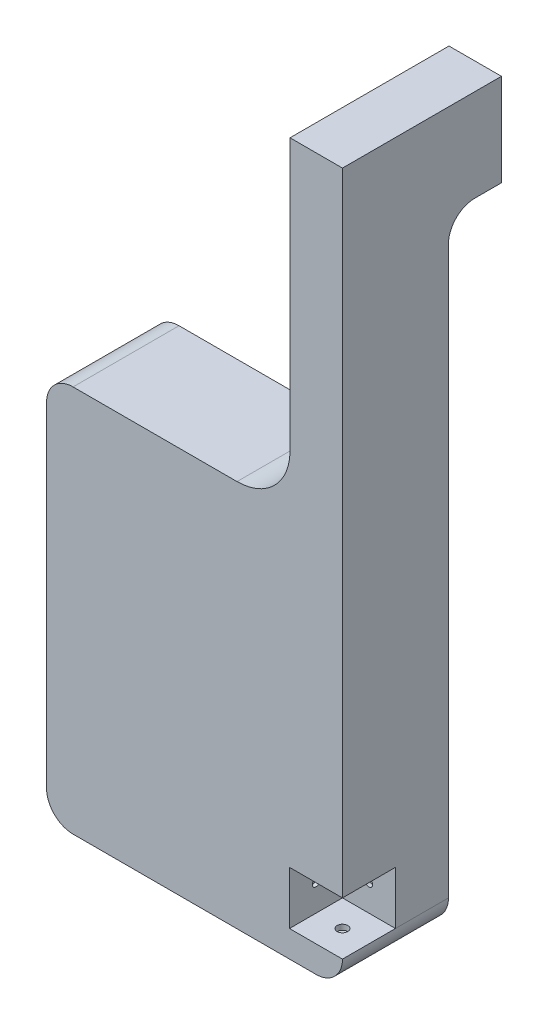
ISO-10303-21;
HEADER;
FILE_DESCRIPTION(('STEP AP214'),'2;1');
FILE_NAME('part.step','',(''),(''),'','','');
FILE_SCHEMA(('AUTOMOTIVE_DESIGN { 1 0 10303 214 1 1 1 1 }'));
ENDSEC;
DATA;
#1=APPLICATION_CONTEXT('core data for automotive mechanical design processes');
#2=APPLICATION_PROTOCOL_DEFINITION('international standard','automotive_design',2000,#1);
#3=PRODUCT_CONTEXT('',#1,'mechanical');
#4=PRODUCT('Part','Part','',(#3));
#5=PRODUCT_RELATED_PRODUCT_CATEGORY('part','',(#4));
#6=PRODUCT_DEFINITION_FORMATION('','',#4);
#7=PRODUCT_DEFINITION_CONTEXT('part definition',#1,'design');
#8=PRODUCT_DEFINITION('design','',#6,#7);
#9=PRODUCT_DEFINITION_SHAPE('','',#8);
#10=(LENGTH_UNIT() NAMED_UNIT(*) SI_UNIT(.MILLI.,.METRE.));
#11=(NAMED_UNIT(*) PLANE_ANGLE_UNIT() SI_UNIT($,.RADIAN.));
#12=(NAMED_UNIT(*) SI_UNIT($,.STERADIAN.) SOLID_ANGLE_UNIT());
#13=UNCERTAINTY_MEASURE_WITH_UNIT(LENGTH_MEASURE(1.E-05),#10,'distance_accuracy_value','');
#14=(GEOMETRIC_REPRESENTATION_CONTEXT(3) GLOBAL_UNCERTAINTY_ASSIGNED_CONTEXT((#13)) GLOBAL_UNIT_ASSIGNED_CONTEXT((#10,
#11,#12)) REPRESENTATION_CONTEXT('',''));
#15=CARTESIAN_POINT('',(0.,0.,0.));
#16=DIRECTION('',(0.,0.,1.));
#17=DIRECTION('',(1.,0.,0.));
#18=AXIS2_PLACEMENT_3D('',#15,#16,#17);
#19=CARTESIAN_POINT('',(5.44816399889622,-9.36239713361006,0.));
#20=DIRECTION('',(0.,0.,1.));
#21=DIRECTION('',(1.,0.,0.));
#22=AXIS2_PLACEMENT_3D('',#19,#20,#21);
#23=PLANE('',#22);
#24=DIRECTION('',(0.,-1.,0.));
#25=VECTOR('',#24,1.);
#26=CARTESIAN_POINT('',(4.20382112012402,10.4736127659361,0.));
#27=LINE('',#26,#25);
#28=CARTESIAN_POINT('',(4.20382112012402,17.782031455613,0.));
#29=VERTEX_POINT('',#28);
#30=CARTESIAN_POINT('',(4.20382112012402,10.4736127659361,0.));
#31=VERTEX_POINT('',#30);
#32=EDGE_CURVE('E217',#29,#31,#27,.T.);
#33=ORIENTED_EDGE('',*,*,#32,.F.);
#34=DIRECTION('',(-1.,0.,0.));
#35=VECTOR('',#34,1.);
#36=CARTESIAN_POINT('',(6.71816399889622,17.782031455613,0.));
#37=LINE('',#36,#35);
#38=CARTESIAN_POINT('',(6.71816399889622,17.782031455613,0.));
#39=VERTEX_POINT('',#38);
#40=EDGE_CURVE('E231',#29,#39,#37,.F.);
#41=ORIENTED_EDGE('',*,*,#40,.T.);
#42=DIRECTION('',(0.,1.,0.));
#43=VECTOR('',#42,1.);
#44=CARTESIAN_POINT('',(6.71816399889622,23.4754600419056,0.));
#45=LINE('',#44,#43);
#46=CARTESIAN_POINT('',(6.71816399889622,-9.36239713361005,0.));
#47=VERTEX_POINT('',#46);
#48=EDGE_CURVE('E213',#47,#39,#45,.T.);
#49=ORIENTED_EDGE('',*,*,#48,.F.);
#50=CARTESIAN_POINT('',(5.44816399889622,-9.36239713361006,0.));
#51=DIRECTION('',(0.,0.,1.));
#52=DIRECTION('',(1.,0.,0.));
#53=AXIS2_PLACEMENT_3D('',#50,#51,#52);
#54=CIRCLE('',#53,1.27);
#55=CARTESIAN_POINT('',(5.44816399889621,-10.6323971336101,0.));
#56=VERTEX_POINT('',#55);
#57=EDGE_CURVE('E188',#56,#47,#54,.T.);
#58=ORIENTED_EDGE('',*,*,#57,.F.);
#59=DIRECTION('',(1.,0.,0.));
#60=VECTOR('',#59,1.);
#61=CARTESIAN_POINT('',(-6.19574889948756,-10.6323971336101,0.));
#62=LINE('',#61,#60);
#63=CARTESIAN_POINT('',(-6.19574889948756,-10.6323971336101,0.));
#64=VERTEX_POINT('',#63);
#65=EDGE_CURVE('E284',#64,#56,#62,.T.);
#66=ORIENTED_EDGE('',*,*,#65,.F.);
#67=CARTESIAN_POINT('',(-6.19574889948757,-9.36239713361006,0.));
#68=DIRECTION('',(0.,0.,1.));
#69=DIRECTION('',(-1.,0.,0.));
#70=AXIS2_PLACEMENT_3D('',#67,#68,#69);
#71=CIRCLE('',#70,1.27);
#72=CARTESIAN_POINT('',(-7.46574889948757,-9.36239713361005,0.));
#73=VERTEX_POINT('',#72);
#74=EDGE_CURVE('E286',#73,#64,#71,.T.);
#75=ORIENTED_EDGE('',*,*,#74,.F.);
#76=DIRECTION('',(0.,-1.,0.));
#77=VECTOR('',#76,1.);
#78=CARTESIAN_POINT('',(-7.46574889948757,-9.36239713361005,0.));
#79=LINE('',#78,#77);
#80=CARTESIAN_POINT('',(-7.46574889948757,6.66361276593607,0.));
#81=VERTEX_POINT('',#80);
#82=EDGE_CURVE('E288',#81,#73,#79,.T.);
#83=ORIENTED_EDGE('',*,*,#82,.F.);
#84=CARTESIAN_POINT('',(-6.19574889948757,6.66361276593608,0.));
#85=DIRECTION('',(0.,0.,1.));
#86=DIRECTION('',(1.,0.,0.));
#87=AXIS2_PLACEMENT_3D('',#84,#85,#86);
#88=CIRCLE('',#87,1.27);
#89=CARTESIAN_POINT('',(-6.19574889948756,7.93361276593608,0.));
#90=VERTEX_POINT('',#89);
#91=EDGE_CURVE('E290',#90,#81,#88,.T.);
#92=ORIENTED_EDGE('',*,*,#91,.F.);
#93=DIRECTION('',(-1.,0.,0.));
#94=VECTOR('',#93,1.);
#95=CARTESIAN_POINT('',(-6.19574889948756,7.93361276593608,0.));
#96=LINE('',#95,#94);
#97=CARTESIAN_POINT('',(1.663821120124,7.93361276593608,0.));
#98=VERTEX_POINT('',#97);
#99=EDGE_CURVE('E292',#98,#90,#96,.T.);
#100=ORIENTED_EDGE('',*,*,#99,.F.);
#101=CARTESIAN_POINT('',(1.66382112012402,10.4736127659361,0.));
#102=DIRECTION('',(0.,0.,-1.));
#103=DIRECTION('',(1.,0.,0.));
#104=AXIS2_PLACEMENT_3D('',#101,#102,#103);
#105=CIRCLE('',#104,2.54);
#106=EDGE_CURVE('E233',#31,#98,#105,.T.);
#107=ORIENTED_EDGE('',*,*,#106,.F.);
#108=EDGE_LOOP('',(#33,#41,#49,#58,#66,#75,#83,#92,#100,#107));
#109=FACE_BOUND('',#108,.T.);
#110=ADVANCED_FACE('F32',(#109),#23,.F.);
#111=CARTESIAN_POINT('',(6.71816399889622,23.4754600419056,5.08));
#112=DIRECTION('',(-1.,0.,0.));
#113=DIRECTION('',(0.,-1.,0.));
#114=AXIS2_PLACEMENT_3D('',#111,#112,#113);
#115=PLANE('',#114);
#116=DIRECTION('',(0.,1.,0.));
#117=VECTOR('',#116,1.);
#118=CARTESIAN_POINT('',(6.71816399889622,23.4754600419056,5.08));
#119=LINE('',#118,#117);
#120=CARTESIAN_POINT('',(6.71816399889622,-6.82239713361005,5.08));
#121=VERTEX_POINT('',#120);
#122=CARTESIAN_POINT('',(6.71816399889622,23.4754600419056,5.08));
#123=VERTEX_POINT('',#122);
#124=EDGE_CURVE('E167',#121,#123,#119,.T.);
#125=ORIENTED_EDGE('',*,*,#124,.F.);
#126=DIRECTION('',(0.,0.,1.));
#127=VECTOR('',#126,1.);
#128=CARTESIAN_POINT('',(6.71816399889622,-6.82239713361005,2.54));
#129=LINE('',#128,#127);
#130=CARTESIAN_POINT('',(6.71816399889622,-6.82239713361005,2.54));
#131=VERTEX_POINT('',#130);
#132=EDGE_CURVE('E47',#131,#121,#129,.T.);
#133=ORIENTED_EDGE('',*,*,#132,.F.);
#134=DIRECTION('',(0.,1.,0.));
#135=VECTOR('',#134,1.);
#136=CARTESIAN_POINT('',(6.71816399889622,-9.36239713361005,2.54));
#137=LINE('',#136,#135);
#138=CARTESIAN_POINT('',(6.71816399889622,-9.36239713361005,2.54));
#139=VERTEX_POINT('',#138);
#140=EDGE_CURVE('E153',#139,#131,#137,.T.);
#141=ORIENTED_EDGE('',*,*,#140,.F.);
#142=DIRECTION('',(0.,0.,-1.));
#143=VECTOR('',#142,1.);
#144=CARTESIAN_POINT('',(6.71816399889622,-9.36239713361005,5.08));
#145=LINE('',#144,#143);
#146=EDGE_CURVE('E207',#139,#47,#145,.T.);
#147=ORIENTED_EDGE('',*,*,#146,.T.);
#148=ORIENTED_EDGE('',*,*,#48,.T.);
#149=CARTESIAN_POINT('',(6.71816399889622,17.782031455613,-1.27));
#150=DIRECTION('',(-1.,0.,0.));
#151=DIRECTION('',(0.,-1.,0.));
#152=AXIS2_PLACEMENT_3D('',#149,#150,#151);
#153=CIRCLE('',#152,1.27);
#154=CARTESIAN_POINT('',(6.71816399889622,19.052031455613,-1.27));
#155=VERTEX_POINT('',#154);
#156=EDGE_CURVE('E11',#39,#155,#153,.T.);
#157=ORIENTED_EDGE('',*,*,#156,.T.);
#158=DIRECTION('',(0.,0.,1.));
#159=VECTOR('',#158,1.);
#160=CARTESIAN_POINT('',(6.71816399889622,19.052031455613,-2.54));
#161=LINE('',#160,#159);
#162=CARTESIAN_POINT('',(6.71816399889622,19.052031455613,-2.54));
#163=VERTEX_POINT('',#162);
#164=EDGE_CURVE('E218',#163,#155,#161,.T.);
#165=ORIENTED_EDGE('',*,*,#164,.F.);
#166=DIRECTION('',(0.,-1.,0.));
#167=VECTOR('',#166,1.);
#168=CARTESIAN_POINT('',(6.71816399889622,23.4754600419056,-2.54));
#169=LINE('',#168,#167);
#170=CARTESIAN_POINT('',(6.71816399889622,23.4754600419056,-2.54));
#171=VERTEX_POINT('',#170);
#172=EDGE_CURVE('E174',#171,#163,#169,.T.);
#173=ORIENTED_EDGE('',*,*,#172,.F.);
#174=DIRECTION('',(0.,0.,-1.));
#175=VECTOR('',#174,1.);
#176=CARTESIAN_POINT('',(6.71816399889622,23.4754600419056,5.08));
#177=LINE('',#176,#175);
#178=EDGE_CURVE('E219',#123,#171,#177,.T.);
#179=ORIENTED_EDGE('',*,*,#178,.F.);
#180=EDGE_LOOP('',(#125,#133,#141,#147,#148,#157,#165,#173,#179));
#181=FACE_BOUND('',#180,.T.);
#182=ADVANCED_FACE('F165',(#181),#115,.F.);
#183=CARTESIAN_POINT('',(4.20382112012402,23.4754600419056,5.08));
#184=DIRECTION('',(0.,-1.,0.));
#185=DIRECTION('',(0.,0.,-1.));
#186=AXIS2_PLACEMENT_3D('',#183,#184,#185);
#187=PLANE('',#186);
#188=ORIENTED_EDGE('',*,*,#178,.T.);
#189=DIRECTION('',(1.,0.,0.));
#190=VECTOR('',#189,1.);
#191=CARTESIAN_POINT('',(6.71816399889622,23.4754600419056,-2.54));
#192=LINE('',#191,#190);
#193=CARTESIAN_POINT('',(4.20382112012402,23.4754600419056,-2.54));
#194=VERTEX_POINT('',#193);
#195=EDGE_CURVE('E182',#194,#171,#192,.T.);
#196=ORIENTED_EDGE('',*,*,#195,.F.);
#197=DIRECTION('',(0.,0.,-1.));
#198=VECTOR('',#197,1.);
#199=CARTESIAN_POINT('',(4.20382112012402,23.4754600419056,5.08));
#200=LINE('',#199,#198);
#201=CARTESIAN_POINT('',(4.20382112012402,23.4754600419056,5.08));
#202=VERTEX_POINT('',#201);
#203=EDGE_CURVE('E251',#202,#194,#200,.T.);
#204=ORIENTED_EDGE('',*,*,#203,.F.);
#205=DIRECTION('',(-1.,0.,0.));
#206=VECTOR('',#205,1.);
#207=CARTESIAN_POINT('',(4.20382112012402,23.4754600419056,5.08));
#208=LINE('',#207,#206);
#209=EDGE_CURVE('E187',#123,#202,#208,.T.);
#210=ORIENTED_EDGE('',*,*,#209,.F.);
#211=EDGE_LOOP('',(#188,#196,#204,#210));
#212=FACE_BOUND('',#211,.T.);
#213=ADVANCED_FACE('F257',(#212),#187,.F.);
#214=CARTESIAN_POINT('',(4.20382112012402,10.4736127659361,5.08));
#215=DIRECTION('',(1.,0.,0.));
#216=DIRECTION('',(0.,0.,-1.));
#217=AXIS2_PLACEMENT_3D('',#214,#215,#216);
#218=PLANE('',#217);
#219=ORIENTED_EDGE('',*,*,#203,.T.);
#220=DIRECTION('',(0.,1.,0.));
#221=VECTOR('',#220,1.);
#222=CARTESIAN_POINT('',(4.20382112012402,23.4754600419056,-2.54));
#223=LINE('',#222,#221);
#224=CARTESIAN_POINT('',(4.20382112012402,19.052031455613,-2.54));
#225=VERTEX_POINT('',#224);
#226=EDGE_CURVE('E179',#225,#194,#223,.T.);
#227=ORIENTED_EDGE('',*,*,#226,.F.);
#228=DIRECTION('',(0.,0.,1.));
#229=VECTOR('',#228,1.);
#230=CARTESIAN_POINT('',(4.20382112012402,19.052031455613,-2.54));
#231=LINE('',#230,#229);
#232=CARTESIAN_POINT('',(4.20382112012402,19.052031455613,-1.27));
#233=VERTEX_POINT('',#232);
#234=EDGE_CURVE('E185',#225,#233,#231,.T.);
#235=ORIENTED_EDGE('',*,*,#234,.T.);
#236=CARTESIAN_POINT('',(4.20382112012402,17.782031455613,-1.27));
#237=DIRECTION('',(1.,0.,0.));
#238=DIRECTION('',(0.,0.,-1.));
#239=AXIS2_PLACEMENT_3D('',#236,#237,#238);
#240=CIRCLE('',#239,1.27);
#241=EDGE_CURVE('E40',#233,#29,#240,.T.);
#242=ORIENTED_EDGE('',*,*,#241,.T.);
#243=ORIENTED_EDGE('',*,*,#32,.T.);
#244=DIRECTION('',(0.,0.,-1.));
#245=VECTOR('',#244,1.);
#246=CARTESIAN_POINT('',(4.20382112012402,10.4736127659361,5.08));
#247=LINE('',#246,#245);
#248=CARTESIAN_POINT('',(4.20382112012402,10.4736127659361,5.08));
#249=VERTEX_POINT('',#248);
#250=EDGE_CURVE('E259',#249,#31,#247,.T.);
#251=ORIENTED_EDGE('',*,*,#250,.F.);
#252=DIRECTION('',(0.,-1.,0.));
#253=VECTOR('',#252,1.);
#254=CARTESIAN_POINT('',(4.20382112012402,20.5585127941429,5.08));
#255=LINE('',#254,#253);
#256=EDGE_CURVE('E190',#202,#249,#255,.T.);
#257=ORIENTED_EDGE('',*,*,#256,.F.);
#258=EDGE_LOOP('',(#219,#227,#235,#242,#243,#251,#257));
#259=FACE_BOUND('',#258,.T.);
#260=ADVANCED_FACE('F248',(#259),#218,.F.);
#261=CARTESIAN_POINT('',(1.66382112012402,10.4736127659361,5.08));
#262=DIRECTION('',(0.,0.,-1.));
#263=DIRECTION('',(-1.,0.,0.));
#264=AXIS2_PLACEMENT_3D('',#261,#262,#263);
#265=CYLINDRICAL_SURFACE('',#264,2.54);
#266=ORIENTED_EDGE('',*,*,#106,.T.);
#267=DIRECTION('',(0.,0.,-1.));
#268=VECTOR('',#267,1.);
#269=CARTESIAN_POINT('',(1.663821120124,7.93361276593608,5.08));
#270=LINE('',#269,#268);
#271=CARTESIAN_POINT('',(1.663821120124,7.93361276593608,5.08));
#272=VERTEX_POINT('',#271);
#273=EDGE_CURVE('E261',#272,#98,#270,.T.);
#274=ORIENTED_EDGE('',*,*,#273,.F.);
#275=CARTESIAN_POINT('',(1.66382112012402,10.4736127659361,5.08));
#276=DIRECTION('',(0.,0.,-1.));
#277=DIRECTION('',(1.,0.,0.));
#278=AXIS2_PLACEMENT_3D('',#275,#276,#277);
#279=CIRCLE('',#278,2.54);
#280=EDGE_CURVE('E192',#249,#272,#279,.T.);
#281=ORIENTED_EDGE('',*,*,#280,.F.);
#282=ORIENTED_EDGE('',*,*,#250,.T.);
#283=EDGE_LOOP('',(#266,#274,#281,#282));
#284=FACE_BOUND('',#283,.T.);
#285=ADVANCED_FACE('F295',(#284),#265,.F.);
#286=CARTESIAN_POINT('',(-6.19574889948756,7.93361276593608,5.08));
#287=DIRECTION('',(0.,-1.,0.));
#288=DIRECTION('',(0.,0.,-1.));
#289=AXIS2_PLACEMENT_3D('',#286,#287,#288);
#290=PLANE('',#289);
#291=ORIENTED_EDGE('',*,*,#99,.T.);
#292=DIRECTION('',(0.,0.,-1.));
#293=VECTOR('',#292,1.);
#294=CARTESIAN_POINT('',(-6.19574889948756,7.93361276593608,5.08));
#295=LINE('',#294,#293);
#296=CARTESIAN_POINT('',(-6.19574889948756,7.93361276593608,5.08));
#297=VERTEX_POINT('',#296);
#298=EDGE_CURVE('E266',#297,#90,#295,.T.);
#299=ORIENTED_EDGE('',*,*,#298,.F.);
#300=DIRECTION('',(-1.,0.,0.));
#301=VECTOR('',#300,1.);
#302=CARTESIAN_POINT('',(-6.19574889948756,7.93361276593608,5.08));
#303=LINE('',#302,#301);
#304=EDGE_CURVE('E194',#272,#297,#303,.T.);
#305=ORIENTED_EDGE('',*,*,#304,.F.);
#306=ORIENTED_EDGE('',*,*,#273,.T.);
#307=EDGE_LOOP('',(#291,#299,#305,#306));
#308=FACE_BOUND('',#307,.T.);
#309=ADVANCED_FACE('F301',(#308),#290,.F.);
#310=CARTESIAN_POINT('',(-6.19574889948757,6.66361276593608,5.08));
#311=DIRECTION('',(0.,0.,-1.));
#312=DIRECTION('',(-1.,0.,0.));
#313=AXIS2_PLACEMENT_3D('',#310,#311,#312);
#314=CYLINDRICAL_SURFACE('',#313,1.27);
#315=ORIENTED_EDGE('',*,*,#91,.T.);
#316=DIRECTION('',(0.,0.,-1.));
#317=VECTOR('',#316,1.);
#318=CARTESIAN_POINT('',(-7.46574889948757,6.66361276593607,5.08));
#319=LINE('',#318,#317);
#320=CARTESIAN_POINT('',(-7.46574889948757,6.66361276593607,5.08));
#321=VERTEX_POINT('',#320);
#322=EDGE_CURVE('E269',#321,#81,#319,.T.);
#323=ORIENTED_EDGE('',*,*,#322,.F.);
#324=CARTESIAN_POINT('',(-6.19574889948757,6.66361276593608,5.08));
#325=DIRECTION('',(0.,0.,1.));
#326=DIRECTION('',(1.,0.,0.));
#327=AXIS2_PLACEMENT_3D('',#324,#325,#326);
#328=CIRCLE('',#327,1.27);
#329=EDGE_CURVE('E196',#297,#321,#328,.T.);
#330=ORIENTED_EDGE('',*,*,#329,.F.);
#331=ORIENTED_EDGE('',*,*,#298,.T.);
#332=EDGE_LOOP('',(#315,#323,#330,#331));
#333=FACE_BOUND('',#332,.T.);
#334=ADVANCED_FACE('F308',(#333),#314,.T.);
#335=CARTESIAN_POINT('',(-7.46574889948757,-9.36239713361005,5.08));
#336=DIRECTION('',(1.,0.,0.));
#337=DIRECTION('',(0.,0.,-1.));
#338=AXIS2_PLACEMENT_3D('',#335,#336,#337);
#339=PLANE('',#338);
#340=ORIENTED_EDGE('',*,*,#82,.T.);
#341=DIRECTION('',(0.,0.,-1.));
#342=VECTOR('',#341,1.);
#343=CARTESIAN_POINT('',(-7.46574889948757,-9.36239713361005,5.08));
#344=LINE('',#343,#342);
#345=CARTESIAN_POINT('',(-7.46574889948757,-9.36239713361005,5.08));
#346=VERTEX_POINT('',#345);
#347=EDGE_CURVE('E272',#346,#73,#344,.T.);
#348=ORIENTED_EDGE('',*,*,#347,.F.);
#349=DIRECTION('',(0.,-1.,0.));
#350=VECTOR('',#349,1.);
#351=CARTESIAN_POINT('',(-7.46574889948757,-9.36239713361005,5.08));
#352=LINE('',#351,#350);
#353=EDGE_CURVE('E198',#321,#346,#352,.T.);
#354=ORIENTED_EDGE('',*,*,#353,.F.);
#355=ORIENTED_EDGE('',*,*,#322,.T.);
#356=EDGE_LOOP('',(#340,#348,#354,#355));
#357=FACE_BOUND('',#356,.T.);
#358=ADVANCED_FACE('F312',(#357),#339,.F.);
#359=CARTESIAN_POINT('',(-6.19574889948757,-9.36239713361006,5.08));
#360=DIRECTION('',(0.,0.,-1.));
#361=DIRECTION('',(-1.,0.,0.));
#362=AXIS2_PLACEMENT_3D('',#359,#360,#361);
#363=CYLINDRICAL_SURFACE('',#362,1.27);
#364=ORIENTED_EDGE('',*,*,#74,.T.);
#365=DIRECTION('',(0.,0.,-1.));
#366=VECTOR('',#365,1.);
#367=CARTESIAN_POINT('',(-6.19574889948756,-10.6323971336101,5.08));
#368=LINE('',#367,#366);
#369=CARTESIAN_POINT('',(-6.19574889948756,-10.6323971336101,5.08));
#370=VERTEX_POINT('',#369);
#371=EDGE_CURVE('E275',#370,#64,#368,.T.);
#372=ORIENTED_EDGE('',*,*,#371,.F.);
#373=CARTESIAN_POINT('',(-6.19574889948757,-9.36239713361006,5.08));
#374=DIRECTION('',(0.,0.,1.));
#375=DIRECTION('',(-1.,0.,0.));
#376=AXIS2_PLACEMENT_3D('',#373,#374,#375);
#377=CIRCLE('',#376,1.27);
#378=EDGE_CURVE('E200',#346,#370,#377,.T.);
#379=ORIENTED_EDGE('',*,*,#378,.F.);
#380=ORIENTED_EDGE('',*,*,#347,.T.);
#381=EDGE_LOOP('',(#364,#372,#379,#380));
#382=FACE_BOUND('',#381,.T.);
#383=ADVANCED_FACE('F345',(#382),#363,.T.);
#384=CARTESIAN_POINT('',(-6.19574889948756,-10.6323971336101,5.08));
#385=DIRECTION('',(0.,1.,0.));
#386=DIRECTION('',(0.,0.,1.));
#387=AXIS2_PLACEMENT_3D('',#384,#385,#386);
#388=PLANE('',#387);
#389=ORIENTED_EDGE('',*,*,#65,.T.);
#390=DIRECTION('',(0.,0.,-1.));
#391=VECTOR('',#390,1.);
#392=CARTESIAN_POINT('',(5.44816399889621,-10.6323971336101,5.08));
#393=LINE('',#392,#391);
#394=CARTESIAN_POINT('',(5.44816399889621,-10.6323971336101,5.08));
#395=VERTEX_POINT('',#394);
#396=EDGE_CURVE('E278',#395,#56,#393,.T.);
#397=ORIENTED_EDGE('',*,*,#396,.F.);
#398=DIRECTION('',(1.,0.,0.));
#399=VECTOR('',#398,1.);
#400=CARTESIAN_POINT('',(-6.19574889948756,-10.6323971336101,5.08));
#401=LINE('',#400,#399);
#402=EDGE_CURVE('E202',#370,#395,#401,.T.);
#403=ORIENTED_EDGE('',*,*,#402,.F.);
#404=ORIENTED_EDGE('',*,*,#371,.T.);
#405=EDGE_LOOP('',(#389,#397,#403,#404));
#406=FACE_BOUND('',#405,.T.);
#407=ADVANCED_FACE('F343',(#406),#388,.F.);
#408=CARTESIAN_POINT('',(5.44816399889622,-9.36239713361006,5.08));
#409=DIRECTION('',(0.,0.,-1.));
#410=DIRECTION('',(-1.,0.,0.));
#411=AXIS2_PLACEMENT_3D('',#408,#409,#410);
#412=CYLINDRICAL_SURFACE('',#411,1.27);
#413=ORIENTED_EDGE('',*,*,#57,.T.);
#414=ORIENTED_EDGE('',*,*,#146,.F.);
#415=CARTESIAN_POINT('',(6.71816399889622,-9.36239713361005,5.08));
#416=VERTEX_POINT('',#415);
#417=EDGE_CURVE('E281',#416,#139,#145,.T.);
#418=ORIENTED_EDGE('',*,*,#417,.F.);
#419=CARTESIAN_POINT('',(5.44816399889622,-9.36239713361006,5.08));
#420=DIRECTION('',(0.,0.,1.));
#421=DIRECTION('',(1.,0.,0.));
#422=AXIS2_PLACEMENT_3D('',#419,#420,#421);
#423=CIRCLE('',#422,1.27);
#424=EDGE_CURVE('E204',#395,#416,#423,.T.);
#425=ORIENTED_EDGE('',*,*,#424,.F.);
#426=ORIENTED_EDGE('',*,*,#396,.T.);
#427=EDGE_LOOP('',(#413,#414,#418,#425,#426));
#428=FACE_BOUND('',#427,.T.);
#429=ADVANCED_FACE('F340',(#428),#412,.T.);
#430=CARTESIAN_POINT('',(5.44816399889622,-9.36239713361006,5.08));
#431=DIRECTION('',(0.,0.,1.));
#432=DIRECTION('',(1.,0.,0.));
#433=AXIS2_PLACEMENT_3D('',#430,#431,#432);
#434=PLANE('',#433);
#435=DIRECTION('',(1.,0.,0.));
#436=VECTOR('',#435,1.);
#437=CARTESIAN_POINT('',(6.71816399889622,-9.36239713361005,5.08));
#438=LINE('',#437,#436);
#439=CARTESIAN_POINT('',(4.17816399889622,-9.36239713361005,5.08));
#440=VERTEX_POINT('',#439);
#441=EDGE_CURVE('E162',#440,#416,#438,.T.);
#442=ORIENTED_EDGE('',*,*,#441,.F.);
#443=DIRECTION('',(0.,-1.,0.));
#444=VECTOR('',#443,1.);
#445=CARTESIAN_POINT('',(4.17816399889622,-9.36239713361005,5.08));
#446=LINE('',#445,#444);
#447=CARTESIAN_POINT('',(4.17816399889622,-6.82239713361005,5.08));
#448=VERTEX_POINT('',#447);
#449=EDGE_CURVE('E322',#448,#440,#446,.T.);
#450=ORIENTED_EDGE('',*,*,#449,.F.);
#451=DIRECTION('',(-1.,0.,0.));
#452=VECTOR('',#451,1.);
#453=CARTESIAN_POINT('',(6.71816399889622,-6.82239713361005,5.08));
#454=LINE('',#453,#452);
#455=EDGE_CURVE('E320',#121,#448,#454,.T.);
#456=ORIENTED_EDGE('',*,*,#455,.F.);
#457=ORIENTED_EDGE('',*,*,#124,.T.);
#458=ORIENTED_EDGE('',*,*,#209,.T.);
#459=ORIENTED_EDGE('',*,*,#256,.T.);
#460=ORIENTED_EDGE('',*,*,#280,.T.);
#461=ORIENTED_EDGE('',*,*,#304,.T.);
#462=ORIENTED_EDGE('',*,*,#329,.T.);
#463=ORIENTED_EDGE('',*,*,#353,.T.);
#464=ORIENTED_EDGE('',*,*,#378,.T.);
#465=ORIENTED_EDGE('',*,*,#402,.T.);
#466=ORIENTED_EDGE('',*,*,#424,.T.);
#467=EDGE_LOOP('',(#442,#450,#456,#457,#458,#459,#460,#461,#462,#463,#464,#465,#466));
#468=FACE_BOUND('',#467,.T.);
#469=ADVANCED_FACE('F317',(#468),#434,.T.);
#470=CARTESIAN_POINT('',(6.71816399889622,19.052031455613,-2.54));
#471=DIRECTION('',(0.,1.,0.));
#472=DIRECTION('',(0.,0.,1.));
#473=AXIS2_PLACEMENT_3D('',#470,#471,#472);
#474=PLANE('',#473);
#475=ORIENTED_EDGE('',*,*,#164,.T.);
#476=DIRECTION('',(-1.,0.,0.));
#477=VECTOR('',#476,1.);
#478=CARTESIAN_POINT('',(4.20382112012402,19.052031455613,-1.27));
#479=LINE('',#478,#477);
#480=EDGE_CURVE('E228',#155,#233,#479,.T.);
#481=ORIENTED_EDGE('',*,*,#480,.T.);
#482=ORIENTED_EDGE('',*,*,#234,.F.);
#483=DIRECTION('',(-1.,0.,0.));
#484=VECTOR('',#483,1.);
#485=CARTESIAN_POINT('',(6.71816399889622,19.052031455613,-2.54));
#486=LINE('',#485,#484);
#487=EDGE_CURVE('E177',#163,#225,#486,.T.);
#488=ORIENTED_EDGE('',*,*,#487,.F.);
#489=EDGE_LOOP('',(#475,#481,#482,#488));
#490=FACE_BOUND('',#489,.T.);
#491=ADVANCED_FACE('F246',(#490),#474,.F.);
#492=CARTESIAN_POINT('',(0.,0.,-2.54));
#493=DIRECTION('',(0.,0.,-1.));
#494=DIRECTION('',(-1.,0.,0.));
#495=AXIS2_PLACEMENT_3D('',#492,#493,#494);
#496=PLANE('',#495);
#497=ORIENTED_EDGE('',*,*,#172,.T.);
#498=ORIENTED_EDGE('',*,*,#487,.T.);
#499=ORIENTED_EDGE('',*,*,#226,.T.);
#500=ORIENTED_EDGE('',*,*,#195,.T.);
#501=EDGE_LOOP('',(#497,#498,#499,#500));
#502=FACE_BOUND('',#501,.T.);
#503=ADVANCED_FACE('F254',(#502),#496,.T.);
#504=CARTESIAN_POINT('',(6.71816399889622,17.782031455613,-1.27));
#505=DIRECTION('',(1.,0.,0.));
#506=DIRECTION('',(0.,0.,-1.));
#507=AXIS2_PLACEMENT_3D('',#504,#505,#506);
#508=CYLINDRICAL_SURFACE('',#507,1.27);
#509=ORIENTED_EDGE('',*,*,#156,.F.);
#510=ORIENTED_EDGE('',*,*,#40,.F.);
#511=ORIENTED_EDGE('',*,*,#241,.F.);
#512=ORIENTED_EDGE('',*,*,#480,.F.);
#513=EDGE_LOOP('',(#509,#510,#511,#512));
#514=FACE_BOUND('',#513,.T.);
#515=ADVANCED_FACE('F34',(#514),#508,.F.);
#516=CARTESIAN_POINT('',(6.71816399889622,-9.36239713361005,2.54));
#517=DIRECTION('',(0.,-1.,0.));
#518=DIRECTION('',(0.,0.,-1.));
#519=AXIS2_PLACEMENT_3D('',#516,#517,#518);
#520=PLANE('',#519);
#521=CARTESIAN_POINT('',(5.44816399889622,-9.36239713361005,3.81));
#522=DIRECTION('',(0.,1.,0.));
#523=DIRECTION('',(0.,0.,1.));
#524=AXIS2_PLACEMENT_3D('',#521,#522,#523);
#525=CIRCLE('',#524,0.254);
#526=CARTESIAN_POINT('',(5.44816399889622,-9.36239713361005,4.064));
#527=VERTEX_POINT('',#526);
#528=EDGE_CURVE('E437',#527,#527,#525,.T.);
#529=ORIENTED_EDGE('',*,*,#528,.F.);
#530=EDGE_LOOP('',(#529));
#531=FACE_BOUND('',#530,.T.);
#532=ORIENTED_EDGE('',*,*,#441,.T.);
#533=ORIENTED_EDGE('',*,*,#417,.T.);
#534=DIRECTION('',(1.,0.,0.));
#535=VECTOR('',#534,1.);
#536=CARTESIAN_POINT('',(6.71816399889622,-9.36239713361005,2.54));
#537=LINE('',#536,#535);
#538=CARTESIAN_POINT('',(4.17816399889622,-9.36239713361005,2.54));
#539=VERTEX_POINT('',#538);
#540=EDGE_CURVE('E159',#539,#139,#537,.T.);
#541=ORIENTED_EDGE('',*,*,#540,.F.);
#542=DIRECTION('',(0.,0.,1.));
#543=VECTOR('',#542,1.);
#544=CARTESIAN_POINT('',(4.17816399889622,-9.36239713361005,2.54));
#545=LINE('',#544,#543);
#546=EDGE_CURVE('E169',#539,#440,#545,.T.);
#547=ORIENTED_EDGE('',*,*,#546,.T.);
#548=EDGE_LOOP('',(#532,#533,#541,#547));
#549=FACE_BOUND('',#548,.T.);
#550=ADVANCED_FACE('F332',(#531,#549),#520,.F.);
#551=CARTESIAN_POINT('',(4.17816399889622,-9.36239713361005,2.54));
#552=DIRECTION('',(-1.,0.,0.));
#553=DIRECTION('',(0.,0.,1.));
#554=AXIS2_PLACEMENT_3D('',#551,#552,#553);
#555=PLANE('',#554);
#556=CARTESIAN_POINT('',(4.17816399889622,-8.09239713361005,3.81));
#557=DIRECTION('',(1.,0.,0.));
#558=DIRECTION('',(0.,0.,-1.));
#559=AXIS2_PLACEMENT_3D('',#556,#557,#558);
#560=CIRCLE('',#559,0.1778);
#561=CARTESIAN_POINT('',(4.17816399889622,-8.09239713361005,3.6322));
#562=VERTEX_POINT('',#561);
#563=EDGE_CURVE('E427',#562,#562,#560,.T.);
#564=ORIENTED_EDGE('',*,*,#563,.F.);
#565=EDGE_LOOP('',(#564));
#566=FACE_BOUND('',#565,.T.);
#567=ORIENTED_EDGE('',*,*,#449,.T.);
#568=ORIENTED_EDGE('',*,*,#546,.F.);
#569=DIRECTION('',(0.,-1.,0.));
#570=VECTOR('',#569,1.);
#571=CARTESIAN_POINT('',(4.17816399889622,-9.36239713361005,2.54));
#572=LINE('',#571,#570);
#573=CARTESIAN_POINT('',(4.17816399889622,-6.82239713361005,2.54));
#574=VERTEX_POINT('',#573);
#575=EDGE_CURVE('E152',#574,#539,#572,.T.);
#576=ORIENTED_EDGE('',*,*,#575,.F.);
#577=DIRECTION('',(0.,0.,1.));
#578=VECTOR('',#577,1.);
#579=CARTESIAN_POINT('',(4.17816399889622,-6.82239713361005,2.54));
#580=LINE('',#579,#578);
#581=EDGE_CURVE('E148',#574,#448,#580,.T.);
#582=ORIENTED_EDGE('',*,*,#581,.T.);
#583=EDGE_LOOP('',(#567,#568,#576,#582));
#584=FACE_BOUND('',#583,.T.);
#585=ADVANCED_FACE('F334',(#566,#584),#555,.F.);
#586=CARTESIAN_POINT('',(6.71816399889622,-6.82239713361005,2.54));
#587=DIRECTION('',(0.,1.,0.));
#588=DIRECTION('',(0.,0.,1.));
#589=AXIS2_PLACEMENT_3D('',#586,#587,#588);
#590=PLANE('',#589);
#591=CARTESIAN_POINT('',(5.44816399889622,-6.82239713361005,3.81));
#592=DIRECTION('',(0.,-1.,0.));
#593=DIRECTION('',(0.,0.,-1.));
#594=AXIS2_PLACEMENT_3D('',#591,#592,#593);
#595=CIRCLE('',#594,0.254);
#596=CARTESIAN_POINT('',(5.44816399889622,-6.82239713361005,3.556));
#597=VERTEX_POINT('',#596);
#598=EDGE_CURVE('E327',#597,#597,#595,.T.);
#599=ORIENTED_EDGE('',*,*,#598,.F.);
#600=EDGE_LOOP('',(#599));
#601=FACE_BOUND('',#600,.T.);
#602=ORIENTED_EDGE('',*,*,#455,.T.);
#603=ORIENTED_EDGE('',*,*,#581,.F.);
#604=DIRECTION('',(-1.,0.,0.));
#605=VECTOR('',#604,1.);
#606=CARTESIAN_POINT('',(6.71816399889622,-6.82239713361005,2.54));
#607=LINE('',#606,#605);
#608=EDGE_CURVE('E145',#131,#574,#607,.T.);
#609=ORIENTED_EDGE('',*,*,#608,.F.);
#610=ORIENTED_EDGE('',*,*,#132,.T.);
#611=EDGE_LOOP('',(#602,#603,#609,#610));
#612=FACE_BOUND('',#611,.T.);
#613=ADVANCED_FACE('F147',(#601,#612),#590,.F.);
#614=CARTESIAN_POINT('',(0.,0.,2.54));
#615=DIRECTION('',(0.,0.,1.));
#616=DIRECTION('',(1.,0.,0.));
#617=AXIS2_PLACEMENT_3D('',#614,#615,#616);
#618=PLANE('',#617);
#619=CARTESIAN_POINT('',(5.44816399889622,-8.09239713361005,2.54));
#620=DIRECTION('',(0.,0.,1.));
#621=DIRECTION('',(1.,0.,0.));
#622=AXIS2_PLACEMENT_3D('',#619,#620,#621);
#623=CIRCLE('',#622,0.177799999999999);
#624=CARTESIAN_POINT('',(5.62596399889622,-8.09239713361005,2.54));
#625=VERTEX_POINT('',#624);
#626=EDGE_CURVE('E428',#625,#625,#623,.T.);
#627=ORIENTED_EDGE('',*,*,#626,.F.);
#628=EDGE_LOOP('',(#627));
#629=FACE_BOUND('',#628,.T.);
#630=ORIENTED_EDGE('',*,*,#140,.T.);
#631=ORIENTED_EDGE('',*,*,#608,.T.);
#632=ORIENTED_EDGE('',*,*,#575,.T.);
#633=ORIENTED_EDGE('',*,*,#540,.T.);
#634=EDGE_LOOP('',(#630,#631,#632,#633));
#635=FACE_BOUND('',#634,.T.);
#636=ADVANCED_FACE('F157',(#629,#635),#618,.T.);
#637=CARTESIAN_POINT('',(5.44816399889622,-6.56839713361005,3.81));
#638=DIRECTION('',(0.,-1.,0.));
#639=DIRECTION('',(0.,0.,-1.));
#640=AXIS2_PLACEMENT_3D('',#637,#638,#639);
#641=CYLINDRICAL_SURFACE('',#640,0.254);
#642=CARTESIAN_POINT('',(5.44816399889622,-6.56839713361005,3.81));
#643=DIRECTION('',(0.,-1.,0.));
#644=DIRECTION('',(0.,0.,-1.));
#645=AXIS2_PLACEMENT_3D('',#642,#643,#644);
#646=CIRCLE('',#645,0.254);
#647=CARTESIAN_POINT('',(5.44816399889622,-6.56839713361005,3.556));
#648=VERTEX_POINT('',#647);
#649=EDGE_CURVE('E323',#648,#648,#646,.T.);
#650=ORIENTED_EDGE('',*,*,#649,.F.);
#651=EDGE_LOOP('',(#650));
#652=FACE_BOUND('',#651,.T.);
#653=ORIENTED_EDGE('',*,*,#598,.T.);
#654=EDGE_LOOP('',(#653));
#655=FACE_BOUND('',#654,.T.);
#656=ADVANCED_FACE('F390',(#652,#655),#641,.F.);
#657=CARTESIAN_POINT('',(5.44816399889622,-6.56839713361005,3.81));
#658=DIRECTION('',(0.,-1.,0.));
#659=DIRECTION('',(0.,0.,-1.));
#660=AXIS2_PLACEMENT_3D('',#657,#658,#659);
#661=PLANE('',#660);
#662=ORIENTED_EDGE('',*,*,#649,.T.);
#663=EDGE_LOOP('',(#662));
#664=FACE_BOUND('',#663,.T.);
#665=ADVANCED_FACE('F394',(#664),#661,.T.);
#666=CARTESIAN_POINT('',(5.44816399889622,-9.61639713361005,3.81));
#667=DIRECTION('',(0.,1.,0.));
#668=DIRECTION('',(0.,0.,1.));
#669=AXIS2_PLACEMENT_3D('',#666,#667,#668);
#670=CYLINDRICAL_SURFACE('',#669,0.254);
#671=CARTESIAN_POINT('',(5.44816399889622,-9.61639713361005,3.81));
#672=DIRECTION('',(0.,1.,0.));
#673=DIRECTION('',(0.,0.,1.));
#674=AXIS2_PLACEMENT_3D('',#671,#672,#673);
#675=CIRCLE('',#674,0.254);
#676=CARTESIAN_POINT('',(5.44816399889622,-9.61639713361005,4.064));
#677=VERTEX_POINT('',#676);
#678=EDGE_CURVE('E439',#677,#677,#675,.T.);
#679=ORIENTED_EDGE('',*,*,#678,.F.);
#680=EDGE_LOOP('',(#679));
#681=FACE_BOUND('',#680,.T.);
#682=ORIENTED_EDGE('',*,*,#528,.T.);
#683=EDGE_LOOP('',(#682));
#684=FACE_BOUND('',#683,.T.);
#685=ADVANCED_FACE('F398',(#681,#684),#670,.F.);
#686=CARTESIAN_POINT('',(5.44816399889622,-9.61639713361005,3.81));
#687=DIRECTION('',(0.,1.,0.));
#688=DIRECTION('',(0.,0.,1.));
#689=AXIS2_PLACEMENT_3D('',#686,#687,#688);
#690=PLANE('',#689);
#691=ORIENTED_EDGE('',*,*,#678,.T.);
#692=EDGE_LOOP('',(#691));
#693=FACE_BOUND('',#692,.T.);
#694=ADVANCED_FACE('F402',(#693),#690,.T.);
#695=CARTESIAN_POINT('',(4.00036399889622,-8.09239713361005,3.81));
#696=DIRECTION('',(1.,0.,0.));
#697=DIRECTION('',(0.,0.,-1.));
#698=AXIS2_PLACEMENT_3D('',#695,#696,#697);
#699=CYLINDRICAL_SURFACE('',#698,0.1778);
#700=CARTESIAN_POINT('',(4.00036399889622,-8.09239713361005,3.81));
#701=DIRECTION('',(1.,0.,0.));
#702=DIRECTION('',(0.,0.,-1.));
#703=AXIS2_PLACEMENT_3D('',#700,#701,#702);
#704=CIRCLE('',#703,0.1778);
#705=CARTESIAN_POINT('',(4.00036399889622,-8.09239713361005,3.6322));
#706=VERTEX_POINT('',#705);
#707=EDGE_CURVE('E431',#706,#706,#704,.T.);
#708=ORIENTED_EDGE('',*,*,#707,.F.);
#709=EDGE_LOOP('',(#708));
#710=FACE_BOUND('',#709,.T.);
#711=ORIENTED_EDGE('',*,*,#563,.T.);
#712=EDGE_LOOP('',(#711));
#713=FACE_BOUND('',#712,.T.);
#714=ADVANCED_FACE('F406',(#710,#713),#699,.F.);
#715=CARTESIAN_POINT('',(4.00036399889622,-8.09239713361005,3.81));
#716=DIRECTION('',(1.,0.,0.));
#717=DIRECTION('',(0.,0.,-1.));
#718=AXIS2_PLACEMENT_3D('',#715,#716,#717);
#719=PLANE('',#718);
#720=ORIENTED_EDGE('',*,*,#707,.T.);
#721=EDGE_LOOP('',(#720));
#722=FACE_BOUND('',#721,.T.);
#723=ADVANCED_FACE('F410',(#722),#719,.T.);
#724=CARTESIAN_POINT('',(5.44816399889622,-8.09239713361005,2.3622));
#725=DIRECTION('',(0.,0.,1.));
#726=DIRECTION('',(1.,0.,0.));
#727=AXIS2_PLACEMENT_3D('',#724,#725,#726);
#728=CYLINDRICAL_SURFACE('',#727,0.177799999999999);
#729=CARTESIAN_POINT('',(5.44816399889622,-8.09239713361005,2.3622));
#730=DIRECTION('',(0.,0.,1.));
#731=DIRECTION('',(1.,0.,0.));
#732=AXIS2_PLACEMENT_3D('',#729,#730,#731);
#733=CIRCLE('',#732,0.177799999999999);
#734=CARTESIAN_POINT('',(5.62596399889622,-8.09239713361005,2.3622));
#735=VERTEX_POINT('',#734);
#736=EDGE_CURVE('E426',#735,#735,#733,.T.);
#737=ORIENTED_EDGE('',*,*,#736,.F.);
#738=EDGE_LOOP('',(#737));
#739=FACE_BOUND('',#738,.T.);
#740=ORIENTED_EDGE('',*,*,#626,.T.);
#741=EDGE_LOOP('',(#740));
#742=FACE_BOUND('',#741,.T.);
#743=ADVANCED_FACE('F414',(#739,#742),#728,.F.);
#744=CARTESIAN_POINT('',(5.44816399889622,-8.09239713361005,2.3622));
#745=DIRECTION('',(0.,0.,1.));
#746=DIRECTION('',(1.,0.,0.));
#747=AXIS2_PLACEMENT_3D('',#744,#745,#746);
#748=PLANE('',#747);
#749=ORIENTED_EDGE('',*,*,#736,.T.);
#750=EDGE_LOOP('',(#749));
#751=FACE_BOUND('',#750,.T.);
#752=ADVANCED_FACE('F418',(#751),#748,.T.);
#753=CLOSED_SHELL('',(#110,#182,#213,#260,#285,#309,#334,#358,#383,#407,#429,#469,#491,#503,
#515,#550,#585,#613,#636,#656,#665,#685,#694,#714,#723,#743,#752));
#754=MANIFOLD_SOLID_BREP('B2',#753);
#755=ADVANCED_BREP_SHAPE_REPRESENTATION('',(#18,#754),#14);
#756=SHAPE_DEFINITION_REPRESENTATION(#9,#755);
ENDSEC;
END-ISO-10303-21;
